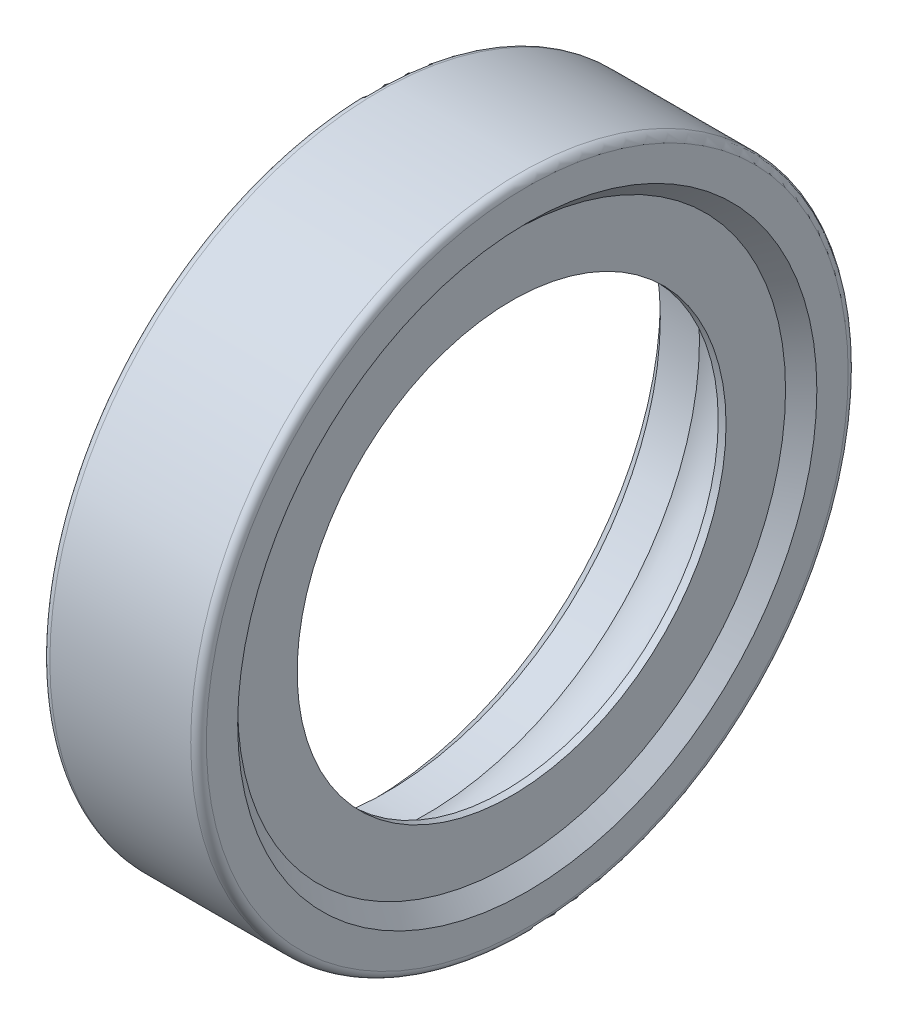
ISO-10303-21;
HEADER;
FILE_DESCRIPTION(('STEP AP214'),'2;1');
FILE_NAME('part.step','',(''),(''),'','','');
FILE_SCHEMA(('AUTOMOTIVE_DESIGN { 1 0 10303 214 1 1 1 1 }'));
ENDSEC;
DATA;
#1=APPLICATION_CONTEXT('core data for automotive mechanical design processes');
#2=APPLICATION_PROTOCOL_DEFINITION('international standard','automotive_design',2000,#1);
#3=PRODUCT_CONTEXT('',#1,'mechanical');
#4=PRODUCT('Part','Part','',(#3));
#5=PRODUCT_RELATED_PRODUCT_CATEGORY('part','',(#4));
#6=PRODUCT_DEFINITION_FORMATION('','',#4);
#7=PRODUCT_DEFINITION_CONTEXT('part definition',#1,'design');
#8=PRODUCT_DEFINITION('design','',#6,#7);
#9=PRODUCT_DEFINITION_SHAPE('','',#8);
#10=(LENGTH_UNIT() NAMED_UNIT(*) SI_UNIT(.MILLI.,.METRE.));
#11=(NAMED_UNIT(*) PLANE_ANGLE_UNIT() SI_UNIT($,.RADIAN.));
#12=(NAMED_UNIT(*) SI_UNIT($,.STERADIAN.) SOLID_ANGLE_UNIT());
#13=UNCERTAINTY_MEASURE_WITH_UNIT(LENGTH_MEASURE(1.E-05),#10,'distance_accuracy_value','');
#14=(GEOMETRIC_REPRESENTATION_CONTEXT(3) GLOBAL_UNCERTAINTY_ASSIGNED_CONTEXT((#13)) GLOBAL_UNIT_ASSIGNED_CONTEXT((#10,
#11,#12)) REPRESENTATION_CONTEXT('',''));
#15=CARTESIAN_POINT('',(0.,0.,0.));
#16=DIRECTION('',(0.,0.,1.));
#17=DIRECTION('',(1.,0.,0.));
#18=AXIS2_PLACEMENT_3D('',#15,#16,#17);
#19=CARTESIAN_POINT('',(5.,20.5,0.));
#20=DIRECTION('',(1.,0.,0.));
#21=DIRECTION('',(0.,0.,-1.));
#22=AXIS2_PLACEMENT_3D('',#19,#20,#21);
#23=PLANE('',#22);
#24=CARTESIAN_POINT('',(5.,0.,0.));
#25=DIRECTION('',(1.,0.,0.));
#26=DIRECTION('',(0.,0.,-1.));
#27=AXIS2_PLACEMENT_3D('',#24,#25,#26);
#28=CIRCLE('',#27,18.5);
#29=CARTESIAN_POINT('',(5.,0.,-18.5));
#30=VERTEX_POINT('',#29);
#31=EDGE_CURVE('E42',#30,#30,#28,.F.);
#32=ORIENTED_EDGE('',*,*,#31,.T.);
#33=EDGE_LOOP('',(#32));
#34=FACE_BOUND('',#33,.T.);
#35=CARTESIAN_POINT('',(5.,0.,0.));
#36=DIRECTION('',(1.,0.,0.));
#37=DIRECTION('',(0.,0.,-1.));
#38=AXIS2_PLACEMENT_3D('',#35,#36,#37);
#39=CIRCLE('',#38,20.5);
#40=CARTESIAN_POINT('',(5.,0.,-20.5));
#41=VERTEX_POINT('',#40);
#42=EDGE_CURVE('E46',#41,#41,#39,.T.);
#43=ORIENTED_EDGE('',*,*,#42,.T.);
#44=EDGE_LOOP('',(#43));
#45=FACE_BOUND('',#44,.T.);
#46=ADVANCED_FACE('F32',(#34,#45),#23,.T.);
#47=CARTESIAN_POINT('',(4.5,0.,0.));
#48=DIRECTION('',(1.,0.,0.));
#49=DIRECTION('',(0.,0.,-1.));
#50=AXIS2_PLACEMENT_3D('',#47,#48,#49);
#51=TOROIDAL_SURFACE('',#50,20.5,0.5);
#52=CARTESIAN_POINT('',(4.49999999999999,0.,0.));
#53=DIRECTION('',(1.,0.,0.));
#54=DIRECTION('',(0.,0.,-1.));
#55=AXIS2_PLACEMENT_3D('',#52,#53,#54);
#56=CIRCLE('',#55,21.);
#57=CARTESIAN_POINT('',(4.49999999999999,0.,-21.));
#58=VERTEX_POINT('',#57);
#59=EDGE_CURVE('E51',#58,#58,#56,.T.);
#60=ORIENTED_EDGE('',*,*,#59,.T.);
#61=EDGE_LOOP('',(#60));
#62=FACE_BOUND('',#61,.T.);
#63=ORIENTED_EDGE('',*,*,#42,.F.);
#64=EDGE_LOOP('',(#63));
#65=FACE_BOUND('',#64,.T.);
#66=ADVANCED_FACE('F97',(#62,#65),#51,.T.);
#67=CARTESIAN_POINT('',(41.6283481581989,0.,0.));
#68=DIRECTION('',(1.,0.,0.));
#69=DIRECTION('',(0.,0.,-1.));
#70=AXIS2_PLACEMENT_3D('',#67,#68,#69);
#71=CYLINDRICAL_SURFACE('',#70,21.);
#72=CARTESIAN_POINT('',(-4.5,0.,0.));
#73=DIRECTION('',(1.,0.,0.));
#74=DIRECTION('',(0.,0.,-1.));
#75=AXIS2_PLACEMENT_3D('',#72,#73,#74);
#76=CIRCLE('',#75,21.);
#77=CARTESIAN_POINT('',(-4.5,0.,-21.));
#78=VERTEX_POINT('',#77);
#79=EDGE_CURVE('E54',#78,#78,#76,.T.);
#80=ORIENTED_EDGE('',*,*,#79,.T.);
#81=EDGE_LOOP('',(#80));
#82=FACE_BOUND('',#81,.T.);
#83=ORIENTED_EDGE('',*,*,#59,.F.);
#84=EDGE_LOOP('',(#83));
#85=FACE_BOUND('',#84,.T.);
#86=ADVANCED_FACE('F102',(#82,#85),#71,.T.);
#87=CARTESIAN_POINT('',(-4.5,0.,0.));
#88=DIRECTION('',(1.,0.,0.));
#89=DIRECTION('',(0.,0.,-1.));
#90=AXIS2_PLACEMENT_3D('',#87,#88,#89);
#91=TOROIDAL_SURFACE('',#90,20.5,0.5);
#92=CARTESIAN_POINT('',(-5.,0.,0.));
#93=DIRECTION('',(1.,0.,0.));
#94=DIRECTION('',(0.,0.,-1.));
#95=AXIS2_PLACEMENT_3D('',#92,#93,#94);
#96=CIRCLE('',#95,20.5);
#97=CARTESIAN_POINT('',(-5.,0.,-20.5));
#98=VERTEX_POINT('',#97);
#99=EDGE_CURVE('E57',#98,#98,#96,.T.);
#100=ORIENTED_EDGE('',*,*,#99,.T.);
#101=EDGE_LOOP('',(#100));
#102=FACE_BOUND('',#101,.T.);
#103=ORIENTED_EDGE('',*,*,#79,.F.);
#104=EDGE_LOOP('',(#103));
#105=FACE_BOUND('',#104,.T.);
#106=ADVANCED_FACE('F110',(#102,#105),#91,.T.);
#107=CARTESIAN_POINT('',(-5.,17.5,0.));
#108=DIRECTION('',(-1.,0.,0.));
#109=DIRECTION('',(0.,0.,1.));
#110=AXIS2_PLACEMENT_3D('',#107,#108,#109);
#111=PLANE('',#110);
#112=CARTESIAN_POINT('',(-5.,0.,0.));
#113=DIRECTION('',(-1.,0.,0.));
#114=DIRECTION('',(0.,0.,1.));
#115=AXIS2_PLACEMENT_3D('',#112,#113,#114);
#116=CIRCLE('',#115,18.5);
#117=CARTESIAN_POINT('',(-5.,0.,18.5));
#118=VERTEX_POINT('',#117);
#119=EDGE_CURVE('E38',#118,#118,#116,.F.);
#120=ORIENTED_EDGE('',*,*,#119,.T.);
#121=EDGE_LOOP('',(#120));
#122=FACE_BOUND('',#121,.T.);
#123=ORIENTED_EDGE('',*,*,#99,.F.);
#124=EDGE_LOOP('',(#123));
#125=FACE_BOUND('',#124,.T.);
#126=ADVANCED_FACE('F116',(#122,#125),#111,.T.);
#127=CARTESIAN_POINT('',(41.6283481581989,0.,0.));
#128=DIRECTION('',(1.,0.,0.));
#129=DIRECTION('',(0.,0.,-1.));
#130=AXIS2_PLACEMENT_3D('',#127,#128,#129);
#131=CYLINDRICAL_SURFACE('',#130,17.5);
#132=CARTESIAN_POINT('',(-4.,0.,0.));
#133=DIRECTION('',(-1.,0.,0.));
#134=DIRECTION('',(0.,0.,1.));
#135=AXIS2_PLACEMENT_3D('',#132,#133,#134);
#136=CIRCLE('',#135,17.5);
#137=CARTESIAN_POINT('',(-4.,0.,17.5));
#138=VERTEX_POINT('',#137);
#139=EDGE_CURVE('E10',#138,#138,#136,.T.);
#140=ORIENTED_EDGE('',*,*,#139,.T.);
#141=EDGE_LOOP('',(#140));
#142=FACE_BOUND('',#141,.T.);
#143=CARTESIAN_POINT('',(-1.49999999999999,0.,0.));
#144=DIRECTION('',(1.,0.,0.));
#145=DIRECTION('',(0.,0.,-1.));
#146=AXIS2_PLACEMENT_3D('',#143,#144,#145);
#147=CIRCLE('',#146,17.5);
#148=CARTESIAN_POINT('',(-1.49999999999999,0.,-17.5));
#149=VERTEX_POINT('',#148);
#150=EDGE_CURVE('E60',#149,#149,#147,.T.);
#151=ORIENTED_EDGE('',*,*,#150,.T.);
#152=EDGE_LOOP('',(#151));
#153=FACE_BOUND('',#152,.T.);
#154=ADVANCED_FACE('F120',(#142,#153),#131,.F.);
#155=CARTESIAN_POINT('',(0.,0.,0.));
#156=DIRECTION('',(1.,0.,0.));
#157=DIRECTION('',(0.,0.,-1.));
#158=AXIS2_PLACEMENT_3D('',#155,#156,#157);
#159=TOROIDAL_SURFACE('',#158,15.5,2.5);
#160=CARTESIAN_POINT('',(1.49999999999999,0.,0.));
#161=DIRECTION('',(1.,0.,0.));
#162=DIRECTION('',(0.,0.,-1.));
#163=AXIS2_PLACEMENT_3D('',#160,#161,#162);
#164=CIRCLE('',#163,17.5);
#165=CARTESIAN_POINT('',(1.49999999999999,0.,-17.5));
#166=VERTEX_POINT('',#165);
#167=EDGE_CURVE('E63',#166,#166,#164,.T.);
#168=ORIENTED_EDGE('',*,*,#167,.T.);
#169=EDGE_LOOP('',(#168));
#170=FACE_BOUND('',#169,.T.);
#171=ORIENTED_EDGE('',*,*,#150,.F.);
#172=EDGE_LOOP('',(#171));
#173=FACE_BOUND('',#172,.T.);
#174=ADVANCED_FACE('F123',(#170,#173),#159,.F.);
#175=CARTESIAN_POINT('',(41.6283481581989,0.,0.));
#176=DIRECTION('',(1.,0.,0.));
#177=DIRECTION('',(0.,0.,-1.));
#178=AXIS2_PLACEMENT_3D('',#175,#176,#177);
#179=CYLINDRICAL_SURFACE('',#178,17.5);
#180=CARTESIAN_POINT('',(3.5,0.,0.));
#181=DIRECTION('',(1.,0.,0.));
#182=DIRECTION('',(0.,0.,-1.));
#183=AXIS2_PLACEMENT_3D('',#180,#181,#182);
#184=CIRCLE('',#183,17.5);
#185=CARTESIAN_POINT('',(3.5,0.,-17.5));
#186=VERTEX_POINT('',#185);
#187=EDGE_CURVE('E66',#186,#186,#184,.T.);
#188=ORIENTED_EDGE('',*,*,#187,.T.);
#189=EDGE_LOOP('',(#188));
#190=FACE_BOUND('',#189,.T.);
#191=ORIENTED_EDGE('',*,*,#167,.F.);
#192=EDGE_LOOP('',(#191));
#193=FACE_BOUND('',#192,.T.);
#194=ADVANCED_FACE('F126',(#190,#193),#179,.F.);
#195=CARTESIAN_POINT('',(3.5,13.7,0.));
#196=DIRECTION('',(-1.,0.,0.));
#197=DIRECTION('',(0.,0.,1.));
#198=AXIS2_PLACEMENT_3D('',#195,#196,#197);
#199=PLANE('',#198);
#200=CARTESIAN_POINT('',(3.5,0.,0.));
#201=DIRECTION('',(1.,0.,0.));
#202=DIRECTION('',(0.,0.,-1.));
#203=AXIS2_PLACEMENT_3D('',#200,#201,#202);
#204=CIRCLE('',#203,13.7);
#205=CARTESIAN_POINT('',(3.5,0.,-13.7));
#206=VERTEX_POINT('',#205);
#207=EDGE_CURVE('E69',#206,#206,#204,.T.);
#208=ORIENTED_EDGE('',*,*,#207,.T.);
#209=EDGE_LOOP('',(#208));
#210=FACE_BOUND('',#209,.T.);
#211=ORIENTED_EDGE('',*,*,#187,.F.);
#212=EDGE_LOOP('',(#211));
#213=FACE_BOUND('',#212,.T.);
#214=ADVANCED_FACE('F130',(#210,#213),#199,.T.);
#215=CARTESIAN_POINT('',(41.6283481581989,0.,0.));
#216=DIRECTION('',(1.,0.,0.));
#217=DIRECTION('',(0.,0.,-1.));
#218=AXIS2_PLACEMENT_3D('',#215,#216,#217);
#219=CYLINDRICAL_SURFACE('',#218,13.7);
#220=CARTESIAN_POINT('',(4.,0.,0.));
#221=DIRECTION('',(1.,0.,0.));
#222=DIRECTION('',(0.,0.,-1.));
#223=AXIS2_PLACEMENT_3D('',#220,#221,#222);
#224=CIRCLE('',#223,13.7);
#225=CARTESIAN_POINT('',(4.,0.,-13.7));
#226=VERTEX_POINT('',#225);
#227=EDGE_CURVE('E72',#226,#226,#224,.T.);
#228=ORIENTED_EDGE('',*,*,#227,.T.);
#229=EDGE_LOOP('',(#228));
#230=FACE_BOUND('',#229,.T.);
#231=ORIENTED_EDGE('',*,*,#207,.F.);
#232=EDGE_LOOP('',(#231));
#233=FACE_BOUND('',#232,.T.);
#234=ADVANCED_FACE('F93',(#230,#233),#219,.F.);
#235=CARTESIAN_POINT('',(4.,17.5,0.));
#236=DIRECTION('',(1.,0.,0.));
#237=DIRECTION('',(0.,0.,-1.));
#238=AXIS2_PLACEMENT_3D('',#235,#236,#237);
#239=PLANE('',#238);
#240=CARTESIAN_POINT('',(4.,0.,0.));
#241=DIRECTION('',(1.,0.,0.));
#242=DIRECTION('',(0.,0.,-1.));
#243=AXIS2_PLACEMENT_3D('',#240,#241,#242);
#244=CIRCLE('',#243,17.5);
#245=CARTESIAN_POINT('',(4.,0.,-17.5));
#246=VERTEX_POINT('',#245);
#247=EDGE_CURVE('E75',#246,#246,#244,.T.);
#248=ORIENTED_EDGE('',*,*,#247,.T.);
#249=EDGE_LOOP('',(#248));
#250=FACE_BOUND('',#249,.T.);
#251=ORIENTED_EDGE('',*,*,#227,.F.);
#252=EDGE_LOOP('',(#251));
#253=FACE_BOUND('',#252,.T.);
#254=ADVANCED_FACE('F79',(#250,#253),#239,.T.);
#255=CARTESIAN_POINT('',(3.99999999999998,0.,0.));
#256=DIRECTION('',(1.,0.,0.));
#257=DIRECTION('',(0.,0.,-1.));
#258=AXIS2_PLACEMENT_3D('',#255,#256,#257);
#259=CONICAL_SURFACE('',#258,17.5,0.785398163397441);
#260=ORIENTED_EDGE('',*,*,#31,.F.);
#261=EDGE_LOOP('',(#260));
#262=FACE_BOUND('',#261,.T.);
#263=ORIENTED_EDGE('',*,*,#247,.F.);
#264=EDGE_LOOP('',(#263));
#265=FACE_BOUND('',#264,.T.);
#266=ADVANCED_FACE('F82',(#262,#265),#259,.F.);
#267=CARTESIAN_POINT('',(-5.,0.,0.));
#268=DIRECTION('',(-1.,0.,0.));
#269=DIRECTION('',(0.,0.,1.));
#270=AXIS2_PLACEMENT_3D('',#267,#268,#269);
#271=CONICAL_SURFACE('',#270,18.5,0.785398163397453);
#272=ORIENTED_EDGE('',*,*,#139,.F.);
#273=EDGE_LOOP('',(#272));
#274=FACE_BOUND('',#273,.T.);
#275=ORIENTED_EDGE('',*,*,#119,.F.);
#276=EDGE_LOOP('',(#275));
#277=FACE_BOUND('',#276,.T.);
#278=ADVANCED_FACE('F84',(#274,#277),#271,.F.);
#279=CLOSED_SHELL('',(#46,#66,#86,#106,#126,#154,#174,#194,#214,#234,#254,#266,#278));
#280=MANIFOLD_SOLID_BREP('B2',#279);
#281=ADVANCED_BREP_SHAPE_REPRESENTATION('',(#18,#280),#14);
#282=SHAPE_DEFINITION_REPRESENTATION(#9,#281);
ENDSEC;
END-ISO-10303-21;
